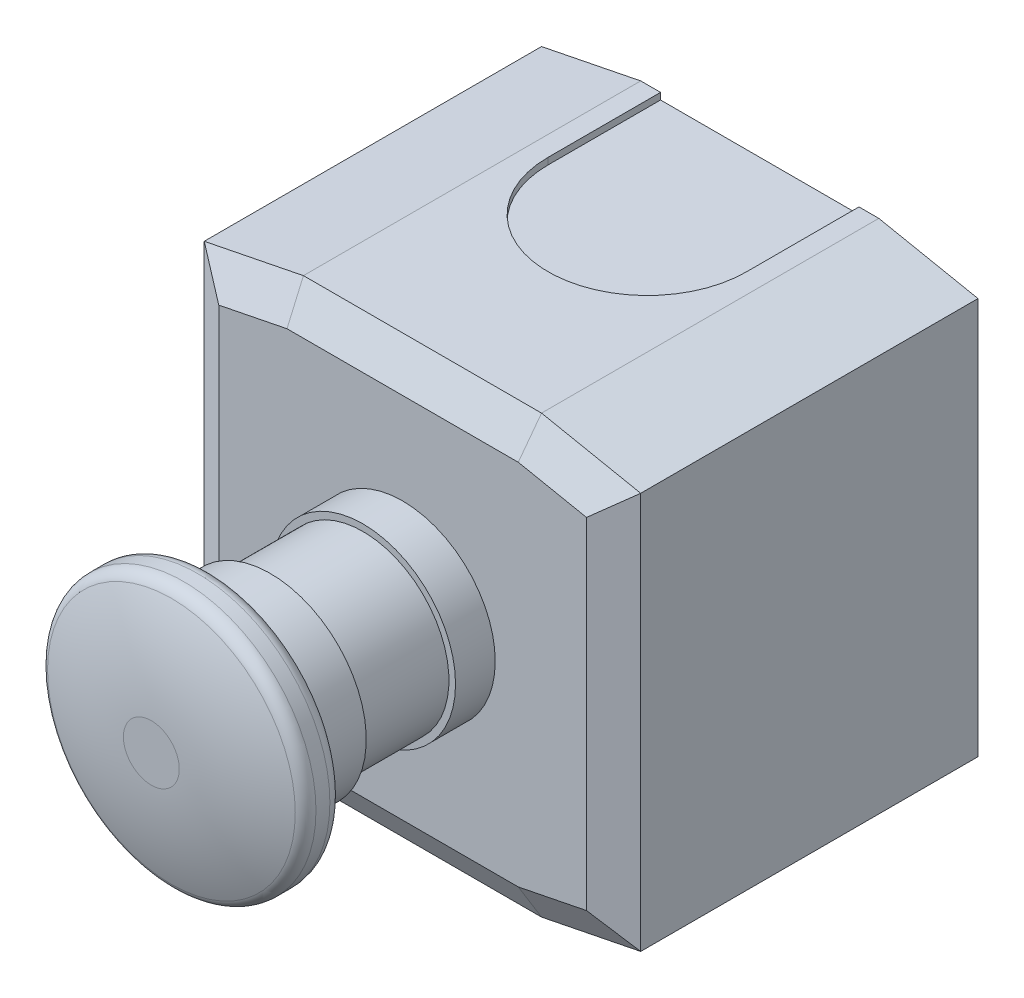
ISO-10303-21;
HEADER;
FILE_DESCRIPTION(('STEP AP214'),'2;1');
FILE_NAME('part.step','',(''),(''),'','','');
FILE_SCHEMA(('AUTOMOTIVE_DESIGN { 1 0 10303 214 1 1 1 1 }'));
ENDSEC;
DATA;
#1=APPLICATION_CONTEXT('core data for automotive mechanical design processes');
#2=APPLICATION_PROTOCOL_DEFINITION('international standard','automotive_design',2000,#1);
#3=PRODUCT_CONTEXT('',#1,'mechanical');
#4=PRODUCT('Part','Part','',(#3));
#5=PRODUCT_RELATED_PRODUCT_CATEGORY('part','',(#4));
#6=PRODUCT_DEFINITION_FORMATION('','',#4);
#7=PRODUCT_DEFINITION_CONTEXT('part definition',#1,'design');
#8=PRODUCT_DEFINITION('design','',#6,#7);
#9=PRODUCT_DEFINITION_SHAPE('','',#8);
#10=(LENGTH_UNIT() NAMED_UNIT(*) SI_UNIT(.MILLI.,.METRE.));
#11=(NAMED_UNIT(*) PLANE_ANGLE_UNIT() SI_UNIT($,.RADIAN.));
#12=(NAMED_UNIT(*) SI_UNIT($,.STERADIAN.) SOLID_ANGLE_UNIT());
#13=UNCERTAINTY_MEASURE_WITH_UNIT(LENGTH_MEASURE(1.E-05),#10,'distance_accuracy_value','');
#14=(GEOMETRIC_REPRESENTATION_CONTEXT(3) GLOBAL_UNCERTAINTY_ASSIGNED_CONTEXT((#13)) GLOBAL_UNIT_ASSIGNED_CONTEXT((#10,
#11,#12)) REPRESENTATION_CONTEXT('',''));
#15=CARTESIAN_POINT('',(0.,0.,0.));
#16=DIRECTION('',(0.,0.,1.));
#17=DIRECTION('',(1.,0.,0.));
#18=AXIS2_PLACEMENT_3D('',#15,#16,#17);
#19=CARTESIAN_POINT('',(-18.,33.,54.));
#20=DIRECTION('',(0.,-1.,0.));
#21=DIRECTION('',(0.,0.,-1.));
#22=AXIS2_PLACEMENT_3D('',#19,#20,#21);
#23=PLANE('',#22);
#24=DIRECTION('',(0.,0.,-1.));
#25=VECTOR('',#24,1.);
#26=CARTESIAN_POINT('',(-15.,33.,0.));
#27=LINE('',#26,#25);
#28=CARTESIAN_POINT('',(-15.,33.,17.));
#29=VERTEX_POINT('',#28);
#30=CARTESIAN_POINT('',(-15.,33.,0.));
#31=VERTEX_POINT('',#30);
#32=EDGE_CURVE('E190',#29,#31,#27,.T.);
#33=ORIENTED_EDGE('',*,*,#32,.T.);
#34=DIRECTION('',(-1.,0.,0.));
#35=VECTOR('',#34,1.);
#36=CARTESIAN_POINT('',(-18.,33.,0.));
#37=LINE('',#36,#35);
#38=CARTESIAN_POINT('',(-18.,33.,0.));
#39=VERTEX_POINT('',#38);
#40=EDGE_CURVE('E253',#31,#39,#37,.T.);
#41=ORIENTED_EDGE('',*,*,#40,.T.);
#42=DIRECTION('',(0.,0.,-1.));
#43=VECTOR('',#42,1.);
#44=CARTESIAN_POINT('',(-18.,33.,54.));
#45=LINE('',#44,#43);
#46=CARTESIAN_POINT('',(-18.,33.,51.));
#47=VERTEX_POINT('',#46);
#48=EDGE_CURVE('E292',#47,#39,#45,.T.);
#49=ORIENTED_EDGE('',*,*,#48,.F.);
#50=DIRECTION('',(1.,0.,0.));
#51=VECTOR('',#50,1.);
#52=CARTESIAN_POINT('',(-18.,33.,51.));
#53=LINE('',#52,#51);
#54=CARTESIAN_POINT('',(18.,33.,51.));
#55=VERTEX_POINT('',#54);
#56=EDGE_CURVE('E11',#47,#55,#53,.T.);
#57=ORIENTED_EDGE('',*,*,#56,.T.);
#58=DIRECTION('',(0.,0.,-1.));
#59=VECTOR('',#58,1.);
#60=CARTESIAN_POINT('',(18.,33.,54.));
#61=LINE('',#60,#59);
#62=CARTESIAN_POINT('',(18.,33.,0.));
#63=VERTEX_POINT('',#62);
#64=EDGE_CURVE('E277',#55,#63,#61,.T.);
#65=ORIENTED_EDGE('',*,*,#64,.T.);
#66=CARTESIAN_POINT('',(15.,33.,0.));
#67=VERTEX_POINT('',#66);
#68=EDGE_CURVE('E189',#63,#67,#37,.T.);
#69=ORIENTED_EDGE('',*,*,#68,.T.);
#70=DIRECTION('',(0.,0.,1.));
#71=VECTOR('',#70,1.);
#72=CARTESIAN_POINT('',(15.,33.,17.));
#73=LINE('',#72,#71);
#74=CARTESIAN_POINT('',(15.,33.,17.));
#75=VERTEX_POINT('',#74);
#76=EDGE_CURVE('E170',#67,#75,#73,.T.);
#77=ORIENTED_EDGE('',*,*,#76,.T.);
#78=CARTESIAN_POINT('',(0.,33.,17.));
#79=DIRECTION('',(0.,-1.,0.));
#80=DIRECTION('',(0.,0.,-1.));
#81=AXIS2_PLACEMENT_3D('',#78,#79,#80);
#82=CIRCLE('',#81,15.);
#83=EDGE_CURVE('E179',#75,#29,#82,.T.);
#84=ORIENTED_EDGE('',*,*,#83,.T.);
#85=EDGE_LOOP('',(#33,#41,#49,#57,#65,#69,#77,#84));
#86=FACE_BOUND('',#85,.T.);
#87=ADVANCED_FACE('F30',(#86),#23,.F.);
#88=CARTESIAN_POINT('',(-33.,33.,0.));
#89=DIRECTION('',(0.,0.,-1.));
#90=DIRECTION('',(-1.,0.,0.));
#91=AXIS2_PLACEMENT_3D('',#88,#89,#90);
#92=PLANE('',#91);
#93=CARTESIAN_POINT('',(-27.,0.,0.));
#94=DIRECTION('',(0.,0.,-1.));
#95=DIRECTION('',(-1.,0.,0.));
#96=AXIS2_PLACEMENT_3D('',#93,#94,#95);
#97=CIRCLE('',#96,2.15);
#98=CARTESIAN_POINT('',(-29.15,0.,0.));
#99=VERTEX_POINT('',#98);
#100=EDGE_CURVE('E745',#99,#99,#97,.T.);
#101=ORIENTED_EDGE('',*,*,#100,.F.);
#102=EDGE_LOOP('',(#101));
#103=FACE_BOUND('',#102,.T.);
#104=CARTESIAN_POINT('',(27.,0.,0.));
#105=DIRECTION('',(0.,0.,-1.));
#106=DIRECTION('',(-1.,0.,0.));
#107=AXIS2_PLACEMENT_3D('',#104,#105,#106);
#108=CIRCLE('',#107,2.15);
#109=CARTESIAN_POINT('',(24.85,0.,0.));
#110=VERTEX_POINT('',#109);
#111=EDGE_CURVE('E744',#110,#110,#108,.T.);
#112=ORIENTED_EDGE('',*,*,#111,.F.);
#113=EDGE_LOOP('',(#112));
#114=FACE_BOUND('',#113,.T.);
#115=ORIENTED_EDGE('',*,*,#40,.F.);
#116=DIRECTION('',(0.,1.,0.));
#117=VECTOR('',#116,1.);
#118=CARTESIAN_POINT('',(-15.,32.,0.));
#119=LINE('',#118,#117);
#120=CARTESIAN_POINT('',(-15.,32.,0.));
#121=VERTEX_POINT('',#120);
#122=EDGE_CURVE('E204',#121,#31,#119,.T.);
#123=ORIENTED_EDGE('',*,*,#122,.F.);
#124=DIRECTION('',(1.,0.,0.));
#125=VECTOR('',#124,1.);
#126=CARTESIAN_POINT('',(15.,32.,0.));
#127=LINE('',#126,#125);
#128=CARTESIAN_POINT('',(15.,32.,0.));
#129=VERTEX_POINT('',#128);
#130=EDGE_CURVE('E198',#121,#129,#127,.T.);
#131=ORIENTED_EDGE('',*,*,#130,.T.);
#132=DIRECTION('',(0.,1.,0.));
#133=VECTOR('',#132,1.);
#134=CARTESIAN_POINT('',(15.,32.,0.));
#135=LINE('',#134,#133);
#136=EDGE_CURVE('E174',#129,#67,#135,.T.);
#137=ORIENTED_EDGE('',*,*,#136,.T.);
#138=ORIENTED_EDGE('',*,*,#68,.F.);
#139=DIRECTION('',(-0.98058067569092,0.196116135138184,0.));
#140=VECTOR('',#139,1.);
#141=CARTESIAN_POINT('',(18.,33.,0.));
#142=LINE('',#141,#140);
#143=CARTESIAN_POINT('',(33.,30.,0.));
#144=VERTEX_POINT('',#143);
#145=EDGE_CURVE('E274',#144,#63,#142,.T.);
#146=ORIENTED_EDGE('',*,*,#145,.F.);
#147=DIRECTION('',(0.,1.,0.));
#148=VECTOR('',#147,1.);
#149=CARTESIAN_POINT('',(33.,30.,0.));
#150=LINE('',#149,#148);
#151=CARTESIAN_POINT('',(33.,-30.,0.));
#152=VERTEX_POINT('',#151);
#153=EDGE_CURVE('E271',#152,#144,#150,.T.);
#154=ORIENTED_EDGE('',*,*,#153,.F.);
#155=DIRECTION('',(0.98058067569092,0.196116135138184,0.));
#156=VECTOR('',#155,1.);
#157=CARTESIAN_POINT('',(18.,-33.,0.));
#158=LINE('',#157,#156);
#159=CARTESIAN_POINT('',(18.,-33.,0.));
#160=VERTEX_POINT('',#159);
#161=EDGE_CURVE('E268',#160,#152,#158,.T.);
#162=ORIENTED_EDGE('',*,*,#161,.F.);
#163=DIRECTION('',(1.,0.,0.));
#164=VECTOR('',#163,1.);
#165=CARTESIAN_POINT('',(-18.,-33.,0.));
#166=LINE('',#165,#164);
#167=CARTESIAN_POINT('',(15.,-33.,0.));
#168=VERTEX_POINT('',#167);
#169=EDGE_CURVE('E264',#168,#160,#166,.T.);
#170=ORIENTED_EDGE('',*,*,#169,.F.);
#171=DIRECTION('',(0.,-1.,0.));
#172=VECTOR('',#171,1.);
#173=CARTESIAN_POINT('',(15.,-32.,0.));
#174=LINE('',#173,#172);
#175=CARTESIAN_POINT('',(15.,-32.,0.));
#176=VERTEX_POINT('',#175);
#177=EDGE_CURVE('E226',#176,#168,#174,.T.);
#178=ORIENTED_EDGE('',*,*,#177,.F.);
#179=DIRECTION('',(1.,0.,0.));
#180=VECTOR('',#179,1.);
#181=CARTESIAN_POINT('',(15.,-32.,0.));
#182=LINE('',#181,#180);
#183=CARTESIAN_POINT('',(-15.,-32.,0.));
#184=VERTEX_POINT('',#183);
#185=EDGE_CURVE('E217',#184,#176,#182,.T.);
#186=ORIENTED_EDGE('',*,*,#185,.F.);
#187=DIRECTION('',(0.,-1.,0.));
#188=VECTOR('',#187,1.);
#189=CARTESIAN_POINT('',(-15.,-32.,0.));
#190=LINE('',#189,#188);
#191=CARTESIAN_POINT('',(-15.,-33.,0.));
#192=VERTEX_POINT('',#191);
#193=EDGE_CURVE('E228',#184,#192,#190,.T.);
#194=ORIENTED_EDGE('',*,*,#193,.T.);
#195=CARTESIAN_POINT('',(-18.,-33.,0.));
#196=VERTEX_POINT('',#195);
#197=EDGE_CURVE('E265',#196,#192,#166,.T.);
#198=ORIENTED_EDGE('',*,*,#197,.F.);
#199=DIRECTION('',(0.98058067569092,-0.196116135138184,0.));
#200=VECTOR('',#199,1.);
#201=CARTESIAN_POINT('',(-18.,-33.,0.));
#202=LINE('',#201,#200);
#203=CARTESIAN_POINT('',(-33.,-30.,0.));
#204=VERTEX_POINT('',#203);
#205=EDGE_CURVE('E261',#204,#196,#202,.T.);
#206=ORIENTED_EDGE('',*,*,#205,.F.);
#207=DIRECTION('',(0.,-1.,0.));
#208=VECTOR('',#207,1.);
#209=CARTESIAN_POINT('',(-33.,30.,0.));
#210=LINE('',#209,#208);
#211=CARTESIAN_POINT('',(-33.,30.,0.));
#212=VERTEX_POINT('',#211);
#213=EDGE_CURVE('E258',#212,#204,#210,.T.);
#214=ORIENTED_EDGE('',*,*,#213,.F.);
#215=DIRECTION('',(-0.98058067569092,-0.196116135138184,0.));
#216=VECTOR('',#215,1.);
#217=CARTESIAN_POINT('',(-18.,33.,0.));
#218=LINE('',#217,#216);
#219=EDGE_CURVE('E255',#39,#212,#218,.T.);
#220=ORIENTED_EDGE('',*,*,#219,.F.);
#221=EDGE_LOOP('',(#115,#123,#131,#137,#138,#146,#154,#162,#170,#178,#186,#194,#198,#206,#214,#220));
#222=FACE_BOUND('',#221,.T.);
#223=ADVANCED_FACE('F358',(#103,#114,#222),#92,.T.);
#224=CARTESIAN_POINT('',(-18.,33.,54.));
#225=DIRECTION('',(0.196116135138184,-0.98058067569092,0.));
#226=DIRECTION('',(0.98058067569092,0.196116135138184,0.));
#227=AXIS2_PLACEMENT_3D('',#224,#225,#226);
#228=PLANE('',#227);
#229=DIRECTION('',(0.,0.,-1.));
#230=VECTOR('',#229,1.);
#231=CARTESIAN_POINT('',(-33.,30.,54.));
#232=LINE('',#231,#230);
#233=CARTESIAN_POINT('',(-33.,30.,51.));
#234=VERTEX_POINT('',#233);
#235=EDGE_CURVE('E290',#234,#212,#232,.T.);
#236=ORIENTED_EDGE('',*,*,#235,.F.);
#237=DIRECTION('',(0.98058067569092,0.196116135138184,0.));
#238=VECTOR('',#237,1.);
#239=CARTESIAN_POINT('',(-18.,33.,51.));
#240=LINE('',#239,#238);
#241=EDGE_CURVE('E37',#234,#47,#240,.T.);
#242=ORIENTED_EDGE('',*,*,#241,.T.);
#243=ORIENTED_EDGE('',*,*,#48,.T.);
#244=ORIENTED_EDGE('',*,*,#219,.T.);
#245=EDGE_LOOP('',(#236,#242,#243,#244));
#246=FACE_BOUND('',#245,.T.);
#247=ADVANCED_FACE('F328',(#246),#228,.F.);
#248=CARTESIAN_POINT('',(-33.,30.,54.));
#249=DIRECTION('',(1.,0.,0.));
#250=DIRECTION('',(0.,0.,-1.));
#251=AXIS2_PLACEMENT_3D('',#248,#249,#250);
#252=PLANE('',#251);
#253=DIRECTION('',(0.,0.,-1.));
#254=VECTOR('',#253,1.);
#255=CARTESIAN_POINT('',(-33.,-30.,54.));
#256=LINE('',#255,#254);
#257=CARTESIAN_POINT('',(-33.,-30.,51.));
#258=VERTEX_POINT('',#257);
#259=EDGE_CURVE('E288',#258,#204,#256,.T.);
#260=ORIENTED_EDGE('',*,*,#259,.F.);
#261=DIRECTION('',(0.,1.,0.));
#262=VECTOR('',#261,1.);
#263=CARTESIAN_POINT('',(-33.,30.,51.));
#264=LINE('',#263,#262);
#265=EDGE_CURVE('E323',#258,#234,#264,.T.);
#266=ORIENTED_EDGE('',*,*,#265,.T.);
#267=ORIENTED_EDGE('',*,*,#235,.T.);
#268=ORIENTED_EDGE('',*,*,#213,.T.);
#269=EDGE_LOOP('',(#260,#266,#267,#268));
#270=FACE_BOUND('',#269,.T.);
#271=ADVANCED_FACE('F368',(#270),#252,.F.);
#272=CARTESIAN_POINT('',(-18.,-33.,54.));
#273=DIRECTION('',(0.196116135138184,0.98058067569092,0.));
#274=DIRECTION('',(-0.98058067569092,0.196116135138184,0.));
#275=AXIS2_PLACEMENT_3D('',#272,#273,#274);
#276=PLANE('',#275);
#277=DIRECTION('',(0.,0.,-1.));
#278=VECTOR('',#277,1.);
#279=CARTESIAN_POINT('',(-18.,-33.,54.));
#280=LINE('',#279,#278);
#281=CARTESIAN_POINT('',(-18.,-33.,51.));
#282=VERTEX_POINT('',#281);
#283=EDGE_CURVE('E286',#282,#196,#280,.T.);
#284=ORIENTED_EDGE('',*,*,#283,.F.);
#285=DIRECTION('',(-0.98058067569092,0.196116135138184,0.));
#286=VECTOR('',#285,1.);
#287=CARTESIAN_POINT('',(-18.,-33.,51.));
#288=LINE('',#287,#286);
#289=EDGE_CURVE('E321',#282,#258,#288,.T.);
#290=ORIENTED_EDGE('',*,*,#289,.T.);
#291=ORIENTED_EDGE('',*,*,#259,.T.);
#292=ORIENTED_EDGE('',*,*,#205,.T.);
#293=EDGE_LOOP('',(#284,#290,#291,#292));
#294=FACE_BOUND('',#293,.T.);
#295=ADVANCED_FACE('F430',(#294),#276,.F.);
#296=CARTESIAN_POINT('',(-18.,-33.,54.));
#297=DIRECTION('',(0.,1.,0.));
#298=DIRECTION('',(0.,0.,1.));
#299=AXIS2_PLACEMENT_3D('',#296,#297,#298);
#300=PLANE('',#299);
#301=CARTESIAN_POINT('',(0.,-33.,17.));
#302=DIRECTION('',(0.,-1.,0.));
#303=DIRECTION('',(0.,0.,-1.));
#304=AXIS2_PLACEMENT_3D('',#301,#302,#303);
#305=CIRCLE('',#304,15.);
#306=CARTESIAN_POINT('',(15.,-33.,17.));
#307=VERTEX_POINT('',#306);
#308=CARTESIAN_POINT('',(-15.,-33.,17.));
#309=VERTEX_POINT('',#308);
#310=EDGE_CURVE('E203',#307,#309,#305,.T.);
#311=ORIENTED_EDGE('',*,*,#310,.F.);
#312=DIRECTION('',(0.,0.,1.));
#313=VECTOR('',#312,1.);
#314=CARTESIAN_POINT('',(15.,-33.,17.));
#315=LINE('',#314,#313);
#316=EDGE_CURVE('E211',#168,#307,#315,.T.);
#317=ORIENTED_EDGE('',*,*,#316,.F.);
#318=ORIENTED_EDGE('',*,*,#169,.T.);
#319=DIRECTION('',(0.,0.,-1.));
#320=VECTOR('',#319,1.);
#321=CARTESIAN_POINT('',(18.,-33.,54.));
#322=LINE('',#321,#320);
#323=CARTESIAN_POINT('',(18.,-33.,51.));
#324=VERTEX_POINT('',#323);
#325=EDGE_CURVE('E283',#324,#160,#322,.T.);
#326=ORIENTED_EDGE('',*,*,#325,.F.);
#327=DIRECTION('',(-1.,0.,0.));
#328=VECTOR('',#327,1.);
#329=CARTESIAN_POINT('',(-18.,-33.,51.));
#330=LINE('',#329,#328);
#331=EDGE_CURVE('E319',#324,#282,#330,.T.);
#332=ORIENTED_EDGE('',*,*,#331,.T.);
#333=ORIENTED_EDGE('',*,*,#283,.T.);
#334=ORIENTED_EDGE('',*,*,#197,.T.);
#335=DIRECTION('',(0.,0.,-1.));
#336=VECTOR('',#335,1.);
#337=CARTESIAN_POINT('',(-15.,-33.,0.));
#338=LINE('',#337,#336);
#339=EDGE_CURVE('E209',#309,#192,#338,.T.);
#340=ORIENTED_EDGE('',*,*,#339,.F.);
#341=EDGE_LOOP('',(#311,#317,#318,#326,#332,#333,#334,#340));
#342=FACE_BOUND('',#341,.T.);
#343=ADVANCED_FACE('F426',(#342),#300,.F.);
#344=CARTESIAN_POINT('',(18.,-33.,54.));
#345=DIRECTION('',(-0.196116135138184,0.98058067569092,0.));
#346=DIRECTION('',(-0.98058067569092,-0.196116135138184,0.));
#347=AXIS2_PLACEMENT_3D('',#344,#345,#346);
#348=PLANE('',#347);
#349=DIRECTION('',(0.,0.,-1.));
#350=VECTOR('',#349,1.);
#351=CARTESIAN_POINT('',(33.,-30.,54.));
#352=LINE('',#351,#350);
#353=CARTESIAN_POINT('',(33.,-30.,51.));
#354=VERTEX_POINT('',#353);
#355=EDGE_CURVE('E281',#354,#152,#352,.T.);
#356=ORIENTED_EDGE('',*,*,#355,.F.);
#357=DIRECTION('',(-0.98058067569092,-0.196116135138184,0.));
#358=VECTOR('',#357,1.);
#359=CARTESIAN_POINT('',(18.,-33.,51.));
#360=LINE('',#359,#358);
#361=EDGE_CURVE('E317',#354,#324,#360,.T.);
#362=ORIENTED_EDGE('',*,*,#361,.T.);
#363=ORIENTED_EDGE('',*,*,#325,.T.);
#364=ORIENTED_EDGE('',*,*,#161,.T.);
#365=EDGE_LOOP('',(#356,#362,#363,#364));
#366=FACE_BOUND('',#365,.T.);
#367=ADVANCED_FACE('F423',(#366),#348,.F.);
#368=CARTESIAN_POINT('',(33.,30.,54.));
#369=DIRECTION('',(-1.,0.,0.));
#370=DIRECTION('',(0.,-1.,0.));
#371=AXIS2_PLACEMENT_3D('',#368,#369,#370);
#372=PLANE('',#371);
#373=DIRECTION('',(0.,0.,-1.));
#374=VECTOR('',#373,1.);
#375=CARTESIAN_POINT('',(33.,30.,54.));
#376=LINE('',#375,#374);
#377=CARTESIAN_POINT('',(33.,30.,51.));
#378=VERTEX_POINT('',#377);
#379=EDGE_CURVE('E279',#378,#144,#376,.T.);
#380=ORIENTED_EDGE('',*,*,#379,.F.);
#381=DIRECTION('',(0.,-1.,0.));
#382=VECTOR('',#381,1.);
#383=CARTESIAN_POINT('',(33.,30.,51.));
#384=LINE('',#383,#382);
#385=EDGE_CURVE('E315',#378,#354,#384,.T.);
#386=ORIENTED_EDGE('',*,*,#385,.T.);
#387=ORIENTED_EDGE('',*,*,#355,.T.);
#388=ORIENTED_EDGE('',*,*,#153,.T.);
#389=EDGE_LOOP('',(#380,#386,#387,#388));
#390=FACE_BOUND('',#389,.T.);
#391=ADVANCED_FACE('F352',(#390),#372,.F.);
#392=CARTESIAN_POINT('',(18.,33.,54.));
#393=DIRECTION('',(-0.196116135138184,-0.98058067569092,0.));
#394=DIRECTION('',(0.98058067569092,-0.196116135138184,0.));
#395=AXIS2_PLACEMENT_3D('',#392,#393,#394);
#396=PLANE('',#395);
#397=ORIENTED_EDGE('',*,*,#64,.F.);
#398=DIRECTION('',(0.98058067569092,-0.196116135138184,0.));
#399=VECTOR('',#398,1.);
#400=CARTESIAN_POINT('',(18.,33.,51.));
#401=LINE('',#400,#399);
#402=EDGE_CURVE('E312',#55,#378,#401,.T.);
#403=ORIENTED_EDGE('',*,*,#402,.T.);
#404=ORIENTED_EDGE('',*,*,#379,.T.);
#405=ORIENTED_EDGE('',*,*,#145,.T.);
#406=EDGE_LOOP('',(#397,#403,#404,#405));
#407=FACE_BOUND('',#406,.T.);
#408=ADVANCED_FACE('F350',(#407),#396,.F.);
#409=CARTESIAN_POINT('',(-33.,33.,54.));
#410=DIRECTION('',(0.,0.,-1.));
#411=DIRECTION('',(-1.,0.,0.));
#412=AXIS2_PLACEMENT_3D('',#409,#410,#411);
#413=PLANE('',#412);
#414=CARTESIAN_POINT('',(0.,0.,54.));
#415=DIRECTION('',(0.,0.,-1.));
#416=DIRECTION('',(-1.,0.,0.));
#417=AXIS2_PLACEMENT_3D('',#414,#415,#416);
#418=CIRCLE('',#417,14.);
#419=CARTESIAN_POINT('',(-14.,0.,54.));
#420=VERTEX_POINT('',#419);
#421=EDGE_CURVE('E755',#420,#420,#418,.T.);
#422=ORIENTED_EDGE('',*,*,#421,.T.);
#423=EDGE_LOOP('',(#422));
#424=FACE_BOUND('',#423,.T.);
#425=DIRECTION('',(0.,1.,0.));
#426=VECTOR('',#425,1.);
#427=CARTESIAN_POINT('',(27.8038475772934,33.,54.));
#428=LINE('',#427,#426);
#429=CARTESIAN_POINT('',(27.8038475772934,-25.7401739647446,54.));
#430=VERTEX_POINT('',#429);
#431=CARTESIAN_POINT('',(27.8038475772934,25.7401739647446,54.));
#432=VERTEX_POINT('',#431);
#433=EDGE_CURVE('E307',#430,#432,#428,.T.);
#434=ORIENTED_EDGE('',*,*,#433,.T.);
#435=DIRECTION('',(-0.98058067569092,0.196116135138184,0.));
#436=VECTOR('',#435,1.);
#437=CARTESIAN_POINT('',(-32.0575108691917,37.7124456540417,54.));
#438=LINE('',#437,#436);
#439=CARTESIAN_POINT('',(17.4854795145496,27.8038475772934,54.));
#440=VERTEX_POINT('',#439);
#441=EDGE_CURVE('E309',#432,#440,#438,.T.);
#442=ORIENTED_EDGE('',*,*,#441,.T.);
#443=DIRECTION('',(-1.,0.,0.));
#444=VECTOR('',#443,1.);
#445=CARTESIAN_POINT('',(-33.,27.8038475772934,54.));
#446=LINE('',#445,#444);
#447=CARTESIAN_POINT('',(-17.4854795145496,27.8038475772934,54.));
#448=VERTEX_POINT('',#447);
#449=EDGE_CURVE('E295',#440,#448,#446,.T.);
#450=ORIENTED_EDGE('',*,*,#449,.T.);
#451=DIRECTION('',(-0.98058067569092,-0.196116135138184,0.));
#452=VECTOR('',#451,1.);
#453=CARTESIAN_POINT('',(-31.4040275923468,25.020137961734,54.));
#454=LINE('',#453,#452);
#455=CARTESIAN_POINT('',(-27.8038475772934,25.7401739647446,54.));
#456=VERTEX_POINT('',#455);
#457=EDGE_CURVE('E297',#448,#456,#454,.T.);
#458=ORIENTED_EDGE('',*,*,#457,.T.);
#459=DIRECTION('',(0.,-1.,0.));
#460=VECTOR('',#459,1.);
#461=CARTESIAN_POINT('',(-27.8038475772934,33.,54.));
#462=LINE('',#461,#460);
#463=CARTESIAN_POINT('',(-27.8038475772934,-25.7401739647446,54.));
#464=VERTEX_POINT('',#463);
#465=EDGE_CURVE('E299',#456,#464,#462,.T.);
#466=ORIENTED_EDGE('',*,*,#465,.T.);
#467=DIRECTION('',(0.98058067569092,-0.196116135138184,0.));
#468=VECTOR('',#467,1.);
#469=CARTESIAN_POINT('',(-44.0963352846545,-22.4816764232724,54.));
#470=LINE('',#469,#468);
#471=CARTESIAN_POINT('',(-17.4854795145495,-27.8038475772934,54.));
#472=VERTEX_POINT('',#471);
#473=EDGE_CURVE('E301',#464,#472,#470,.T.);
#474=ORIENTED_EDGE('',*,*,#473,.T.);
#475=DIRECTION('',(1.,0.,0.));
#476=VECTOR('',#475,1.);
#477=CARTESIAN_POINT('',(-33.,-27.8038475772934,54.));
#478=LINE('',#477,#476);
#479=CARTESIAN_POINT('',(17.4854795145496,-27.8038475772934,54.));
#480=VERTEX_POINT('',#479);
#481=EDGE_CURVE('E303',#472,#480,#478,.T.);
#482=ORIENTED_EDGE('',*,*,#481,.T.);
#483=DIRECTION('',(0.98058067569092,0.196116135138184,0.));
#484=VECTOR('',#483,1.);
#485=CARTESIAN_POINT('',(-19.365203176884,-35.1739841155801,54.));
#486=LINE('',#485,#484);
#487=EDGE_CURVE('E305',#480,#430,#486,.T.);
#488=ORIENTED_EDGE('',*,*,#487,.T.);
#489=EDGE_LOOP('',(#434,#442,#450,#458,#466,#474,#482,#488));
#490=FACE_BOUND('',#489,.T.);
#491=ADVANCED_FACE('F376',(#424,#490),#413,.F.);
#492=CARTESIAN_POINT('',(-44.0963352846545,-22.4816764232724,54.));
#493=DIRECTION('',(0.0980580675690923,0.490290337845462,-0.866025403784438));
#494=DIRECTION('',(0.,0.870219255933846,0.492664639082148));
#495=AXIS2_PLACEMENT_3D('',#492,#493,#494);
#496=PLANE('',#495);
#497=DIRECTION('',(0.706152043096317,0.578906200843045,0.407697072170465));
#498=VECTOR('',#497,1.);
#499=CARTESIAN_POINT('',(-3.7911113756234,-6.05443911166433,67.8637597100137));
#500=LINE('',#499,#498);
#501=EDGE_CURVE('E247',#258,#464,#500,.T.);
#502=ORIENTED_EDGE('',*,*,#501,.F.);
#503=ORIENTED_EDGE('',*,*,#289,.F.);
#504=DIRECTION('',(0.085439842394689,0.862858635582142,0.498171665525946));
#505=VECTOR('',#504,1.);
#506=CARTESIAN_POINT('',(-17.287374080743,-25.8031769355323,55.1550877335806));
#507=LINE('',#506,#505);
#508=EDGE_CURVE('E250',#472,#282,#507,.F.);
#509=ORIENTED_EDGE('',*,*,#508,.F.);
#510=ORIENTED_EDGE('',*,*,#473,.F.);
#511=EDGE_LOOP('',(#502,#503,#509,#510));
#512=FACE_BOUND('',#511,.T.);
#513=ADVANCED_FACE('F379',(#512),#496,.F.);
#514=CARTESIAN_POINT('',(-33.,-27.8038475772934,54.));
#515=DIRECTION('',(0.,0.500000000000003,-0.866025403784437));
#516=DIRECTION('',(0.,0.866025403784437,0.500000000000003));
#517=AXIS2_PLACEMENT_3D('',#514,#515,#516);
#518=PLANE('',#517);
#519=ORIENTED_EDGE('',*,*,#508,.T.);
#520=ORIENTED_EDGE('',*,*,#331,.F.);
#521=DIRECTION('',(-0.0854398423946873,0.862858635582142,0.498171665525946));
#522=VECTOR('',#521,1.);
#523=CARTESIAN_POINT('',(17.1169371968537,-24.0819315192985,56.1488492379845));
#524=LINE('',#523,#522);
#525=EDGE_CURVE('E244',#480,#324,#524,.F.);
#526=ORIENTED_EDGE('',*,*,#525,.F.);
#527=ORIENTED_EDGE('',*,*,#481,.F.);
#528=EDGE_LOOP('',(#519,#520,#526,#527));
#529=FACE_BOUND('',#528,.T.);
#530=ADVANCED_FACE('F385',(#529),#518,.F.);
#531=CARTESIAN_POINT('',(-27.8038475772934,33.,54.));
#532=DIRECTION('',(0.500000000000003,0.,-0.866025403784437));
#533=DIRECTION('',(-0.866025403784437,0.,-0.500000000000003));
#534=AXIS2_PLACEMENT_3D('',#531,#532,#533);
#535=PLANE('',#534);
#536=ORIENTED_EDGE('',*,*,#501,.T.);
#537=ORIENTED_EDGE('',*,*,#465,.F.);
#538=DIRECTION('',(0.706152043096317,-0.578906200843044,0.407697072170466));
#539=VECTOR('',#538,1.);
#540=CARTESIAN_POINT('',(-29.3047321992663,26.9706050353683,53.1334638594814));
#541=LINE('',#540,#539);
#542=EDGE_CURVE('E241',#234,#456,#541,.T.);
#543=ORIENTED_EDGE('',*,*,#542,.F.);
#544=ORIENTED_EDGE('',*,*,#265,.F.);
#545=EDGE_LOOP('',(#536,#537,#543,#544));
#546=FACE_BOUND('',#545,.T.);
#547=ADVANCED_FACE('F372',(#546),#535,.F.);
#548=CARTESIAN_POINT('',(-19.365203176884,-35.1739841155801,54.));
#549=DIRECTION('',(-0.0980580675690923,0.490290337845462,-0.866025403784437));
#550=DIRECTION('',(0.,0.870219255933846,0.492664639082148));
#551=AXIS2_PLACEMENT_3D('',#548,#549,#550);
#552=PLANE('',#551);
#553=ORIENTED_EDGE('',*,*,#525,.T.);
#554=ORIENTED_EDGE('',*,*,#361,.F.);
#555=DIRECTION('',(-0.706152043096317,0.578906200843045,0.407697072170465));
#556=VECTOR('',#555,1.);
#557=CARTESIAN_POINT('',(8.13946895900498,-9.61923962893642,65.3532342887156));
#558=LINE('',#557,#556);
#559=EDGE_CURVE('E238',#430,#354,#558,.F.);
#560=ORIENTED_EDGE('',*,*,#559,.F.);
#561=ORIENTED_EDGE('',*,*,#487,.F.);
#562=EDGE_LOOP('',(#553,#554,#560,#561));
#563=FACE_BOUND('',#562,.T.);
#564=ADVANCED_FACE('F391',(#563),#552,.F.);
#565=CARTESIAN_POINT('',(-31.4040275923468,25.020137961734,54.));
#566=DIRECTION('',(0.0980580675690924,-0.490290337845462,-0.866025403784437));
#567=DIRECTION('',(0.,0.870219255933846,-0.492664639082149));
#568=AXIS2_PLACEMENT_3D('',#565,#566,#567);
#569=PLANE('',#568);
#570=ORIENTED_EDGE('',*,*,#542,.T.);
#571=ORIENTED_EDGE('',*,*,#457,.F.);
#572=DIRECTION('',(0.0854398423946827,-0.862858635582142,0.498171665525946));
#573=VECTOR('',#572,1.);
#574=CARTESIAN_POINT('',(-17.59873499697,28.9476169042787,53.3396444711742));
#575=LINE('',#574,#573);
#576=EDGE_CURVE('E235',#47,#448,#575,.T.);
#577=ORIENTED_EDGE('',*,*,#576,.F.);
#578=ORIENTED_EDGE('',*,*,#241,.F.);
#579=EDGE_LOOP('',(#570,#571,#577,#578));
#580=FACE_BOUND('',#579,.T.);
#581=ADVANCED_FACE('F337',(#580),#569,.F.);
#582=CARTESIAN_POINT('',(27.8038475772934,33.,54.));
#583=DIRECTION('',(-0.500000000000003,0.,-0.866025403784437));
#584=DIRECTION('',(-0.866025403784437,0.,0.500000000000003));
#585=AXIS2_PLACEMENT_3D('',#582,#583,#584);
#586=PLANE('',#585);
#587=ORIENTED_EDGE('',*,*,#559,.T.);
#588=ORIENTED_EDGE('',*,*,#385,.F.);
#589=DIRECTION('',(-0.706152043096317,-0.578906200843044,0.407697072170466));
#590=VECTOR('',#589,1.);
#591=CARTESIAN_POINT('',(30.7716339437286,28.1731768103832,52.2865477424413));
#592=LINE('',#591,#590);
#593=EDGE_CURVE('E233',#432,#378,#592,.F.);
#594=ORIENTED_EDGE('',*,*,#593,.F.);
#595=ORIENTED_EDGE('',*,*,#433,.F.);
#596=EDGE_LOOP('',(#587,#588,#594,#595));
#597=FACE_BOUND('',#596,.T.);
#598=ADVANCED_FACE('F393',(#597),#586,.F.);
#599=CARTESIAN_POINT('',(-33.,27.8038475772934,54.));
#600=DIRECTION('',(0.,-0.500000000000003,-0.866025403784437));
#601=DIRECTION('',(0.,0.866025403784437,-0.500000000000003));
#602=AXIS2_PLACEMENT_3D('',#599,#600,#601);
#603=PLANE('',#602);
#604=ORIENTED_EDGE('',*,*,#576,.T.);
#605=ORIENTED_EDGE('',*,*,#449,.F.);
#606=DIRECTION('',(0.0854398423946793,0.862858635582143,-0.498171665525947));
#607=VECTOR('',#606,1.);
#608=CARTESIAN_POINT('',(17.1169371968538,24.0819315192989,56.1488492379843));
#609=LINE('',#608,#607);
#610=EDGE_CURVE('E225',#55,#440,#609,.F.);
#611=ORIENTED_EDGE('',*,*,#610,.F.);
#612=ORIENTED_EDGE('',*,*,#56,.F.);
#613=EDGE_LOOP('',(#604,#605,#611,#612));
#614=FACE_BOUND('',#613,.T.);
#615=ADVANCED_FACE('F341',(#614),#603,.F.);
#616=CARTESIAN_POINT('',(-32.0575108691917,37.7124456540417,54.));
#617=DIRECTION('',(-0.0980580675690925,-0.490290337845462,-0.866025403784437));
#618=DIRECTION('',(0.,0.870219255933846,-0.492664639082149));
#619=AXIS2_PLACEMENT_3D('',#616,#617,#618);
#620=PLANE('',#619);
#621=ORIENTED_EDGE('',*,*,#593,.T.);
#622=ORIENTED_EDGE('',*,*,#402,.F.);
#623=ORIENTED_EDGE('',*,*,#610,.T.);
#624=ORIENTED_EDGE('',*,*,#441,.F.);
#625=EDGE_LOOP('',(#621,#622,#623,#624));
#626=FACE_BOUND('',#625,.T.);
#627=ADVANCED_FACE('F345',(#626),#620,.F.);
#628=CARTESIAN_POINT('',(0.,-32.,17.));
#629=DIRECTION('',(0.,-1.,0.));
#630=DIRECTION('',(0.,0.,-1.));
#631=AXIS2_PLACEMENT_3D('',#628,#629,#630);
#632=CYLINDRICAL_SURFACE('',#631,15.);
#633=ORIENTED_EDGE('',*,*,#310,.T.);
#634=DIRECTION('',(0.,-1.,0.));
#635=VECTOR('',#634,1.);
#636=CARTESIAN_POINT('',(-15.,-32.,17.));
#637=LINE('',#636,#635);
#638=CARTESIAN_POINT('',(-15.,-32.,17.));
#639=VERTEX_POINT('',#638);
#640=EDGE_CURVE('E222',#639,#309,#637,.T.);
#641=ORIENTED_EDGE('',*,*,#640,.F.);
#642=CARTESIAN_POINT('',(0.,-32.,17.));
#643=DIRECTION('',(0.,-1.,0.));
#644=DIRECTION('',(0.,0.,-1.));
#645=AXIS2_PLACEMENT_3D('',#642,#643,#644);
#646=CIRCLE('',#645,15.);
#647=CARTESIAN_POINT('',(15.,-32.,17.));
#648=VERTEX_POINT('',#647);
#649=EDGE_CURVE('E214',#648,#639,#646,.T.);
#650=ORIENTED_EDGE('',*,*,#649,.F.);
#651=DIRECTION('',(0.,-1.,0.));
#652=VECTOR('',#651,1.);
#653=CARTESIAN_POINT('',(15.,-32.,17.));
#654=LINE('',#653,#652);
#655=EDGE_CURVE('E223',#648,#307,#654,.T.);
#656=ORIENTED_EDGE('',*,*,#655,.T.);
#657=EDGE_LOOP('',(#633,#641,#650,#656));
#658=FACE_BOUND('',#657,.T.);
#659=ADVANCED_FACE('F511',(#658),#632,.F.);
#660=CARTESIAN_POINT('',(15.,-32.,17.));
#661=DIRECTION('',(1.,0.,0.));
#662=DIRECTION('',(0.,0.,-1.));
#663=AXIS2_PLACEMENT_3D('',#660,#661,#662);
#664=PLANE('',#663);
#665=ORIENTED_EDGE('',*,*,#316,.T.);
#666=ORIENTED_EDGE('',*,*,#655,.F.);
#667=DIRECTION('',(0.,0.,1.));
#668=VECTOR('',#667,1.);
#669=CARTESIAN_POINT('',(15.,-32.,17.));
#670=LINE('',#669,#668);
#671=EDGE_CURVE('E219',#176,#648,#670,.T.);
#672=ORIENTED_EDGE('',*,*,#671,.F.);
#673=ORIENTED_EDGE('',*,*,#177,.T.);
#674=EDGE_LOOP('',(#665,#666,#672,#673));
#675=FACE_BOUND('',#674,.T.);
#676=ADVANCED_FACE('F520',(#675),#664,.F.);
#677=CARTESIAN_POINT('',(-15.,-32.,0.));
#678=DIRECTION('',(-1.,0.,0.));
#679=DIRECTION('',(0.,0.,1.));
#680=AXIS2_PLACEMENT_3D('',#677,#678,#679);
#681=PLANE('',#680);
#682=ORIENTED_EDGE('',*,*,#339,.T.);
#683=ORIENTED_EDGE('',*,*,#193,.F.);
#684=DIRECTION('',(0.,0.,-1.));
#685=VECTOR('',#684,1.);
#686=CARTESIAN_POINT('',(-15.,-32.,0.));
#687=LINE('',#686,#685);
#688=EDGE_CURVE('E52',#639,#184,#687,.T.);
#689=ORIENTED_EDGE('',*,*,#688,.F.);
#690=ORIENTED_EDGE('',*,*,#640,.T.);
#691=EDGE_LOOP('',(#682,#683,#689,#690));
#692=FACE_BOUND('',#691,.T.);
#693=ADVANCED_FACE('F527',(#692),#681,.F.);
#694=CARTESIAN_POINT('',(0.,-32.,17.));
#695=DIRECTION('',(0.,-1.,0.));
#696=DIRECTION('',(0.,0.,-1.));
#697=AXIS2_PLACEMENT_3D('',#694,#695,#696);
#698=PLANE('',#697);
#699=ORIENTED_EDGE('',*,*,#649,.T.);
#700=ORIENTED_EDGE('',*,*,#688,.T.);
#701=ORIENTED_EDGE('',*,*,#185,.T.);
#702=ORIENTED_EDGE('',*,*,#671,.T.);
#703=EDGE_LOOP('',(#699,#700,#701,#702));
#704=FACE_BOUND('',#703,.T.);
#705=ADVANCED_FACE('F535',(#704),#698,.T.);
#706=CARTESIAN_POINT('',(0.,32.,17.));
#707=DIRECTION('',(0.,1.,0.));
#708=DIRECTION('',(0.,0.,1.));
#709=AXIS2_PLACEMENT_3D('',#706,#707,#708);
#710=CYLINDRICAL_SURFACE('',#709,15.);
#711=ORIENTED_EDGE('',*,*,#83,.F.);
#712=DIRECTION('',(0.,1.,0.));
#713=VECTOR('',#712,1.);
#714=CARTESIAN_POINT('',(15.,32.,17.));
#715=LINE('',#714,#713);
#716=CARTESIAN_POINT('',(15.,32.,17.));
#717=VERTEX_POINT('',#716);
#718=EDGE_CURVE('E166',#717,#75,#715,.T.);
#719=ORIENTED_EDGE('',*,*,#718,.F.);
#720=CARTESIAN_POINT('',(0.,32.,17.));
#721=DIRECTION('',(0.,-1.,0.));
#722=DIRECTION('',(0.,0.,-1.));
#723=AXIS2_PLACEMENT_3D('',#720,#721,#722);
#724=CIRCLE('',#723,15.);
#725=CARTESIAN_POINT('',(-15.,32.,17.));
#726=VERTEX_POINT('',#725);
#727=EDGE_CURVE('E192',#717,#726,#724,.T.);
#728=ORIENTED_EDGE('',*,*,#727,.T.);
#729=DIRECTION('',(0.,1.,0.));
#730=VECTOR('',#729,1.);
#731=CARTESIAN_POINT('',(-15.,32.,17.));
#732=LINE('',#731,#730);
#733=EDGE_CURVE('E182',#726,#29,#732,.T.);
#734=ORIENTED_EDGE('',*,*,#733,.T.);
#735=EDGE_LOOP('',(#711,#719,#728,#734));
#736=FACE_BOUND('',#735,.T.);
#737=ADVANCED_FACE('F180',(#736),#710,.F.);
#738=CARTESIAN_POINT('',(-15.,32.,0.));
#739=DIRECTION('',(1.,0.,0.));
#740=DIRECTION('',(0.,0.,-1.));
#741=AXIS2_PLACEMENT_3D('',#738,#739,#740);
#742=PLANE('',#741);
#743=ORIENTED_EDGE('',*,*,#32,.F.);
#744=ORIENTED_EDGE('',*,*,#733,.F.);
#745=DIRECTION('',(0.,0.,-1.));
#746=VECTOR('',#745,1.);
#747=CARTESIAN_POINT('',(-15.,32.,0.));
#748=LINE('',#747,#746);
#749=EDGE_CURVE('E175',#726,#121,#748,.T.);
#750=ORIENTED_EDGE('',*,*,#749,.T.);
#751=ORIENTED_EDGE('',*,*,#122,.T.);
#752=EDGE_LOOP('',(#743,#744,#750,#751));
#753=FACE_BOUND('',#752,.T.);
#754=ADVANCED_FACE('F362',(#753),#742,.T.);
#755=CARTESIAN_POINT('',(15.,32.,17.));
#756=DIRECTION('',(-1.,0.,0.));
#757=DIRECTION('',(0.,0.,1.));
#758=AXIS2_PLACEMENT_3D('',#755,#756,#757);
#759=PLANE('',#758);
#760=ORIENTED_EDGE('',*,*,#76,.F.);
#761=ORIENTED_EDGE('',*,*,#136,.F.);
#762=DIRECTION('',(0.,0.,1.));
#763=VECTOR('',#762,1.);
#764=CARTESIAN_POINT('',(15.,32.,17.));
#765=LINE('',#764,#763);
#766=EDGE_CURVE('E44',#129,#717,#765,.T.);
#767=ORIENTED_EDGE('',*,*,#766,.T.);
#768=ORIENTED_EDGE('',*,*,#718,.T.);
#769=EDGE_LOOP('',(#760,#761,#767,#768));
#770=FACE_BOUND('',#769,.T.);
#771=ADVANCED_FACE('F168',(#770),#759,.T.);
#772=CARTESIAN_POINT('',(0.,32.,17.));
#773=DIRECTION('',(0.,1.,0.));
#774=DIRECTION('',(0.,0.,-1.));
#775=AXIS2_PLACEMENT_3D('',#772,#773,#774);
#776=PLANE('',#775);
#777=ORIENTED_EDGE('',*,*,#727,.F.);
#778=ORIENTED_EDGE('',*,*,#766,.F.);
#779=ORIENTED_EDGE('',*,*,#130,.F.);
#780=ORIENTED_EDGE('',*,*,#749,.F.);
#781=EDGE_LOOP('',(#777,#778,#779,#780));
#782=FACE_BOUND('',#781,.T.);
#783=ADVANCED_FACE('F360',(#782),#776,.T.);
#784=CARTESIAN_POINT('',(0.,4.22536179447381,92.));
#785=DIRECTION('',(0.,0.,1.));
#786=DIRECTION('',(1.,0.,0.));
#787=AXIS2_PLACEMENT_3D('',#784,#785,#786);
#788=PLANE('',#787);
#789=CARTESIAN_POINT('',(0.,0.,92.));
#790=DIRECTION('',(0.,0.,-1.));
#791=DIRECTION('',(-1.,0.,0.));
#792=AXIS2_PLACEMENT_3D('',#789,#790,#791);
#793=CIRCLE('',#792,4.22536179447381);
#794=CARTESIAN_POINT('',(-4.22536179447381,0.,92.));
#795=VERTEX_POINT('',#794);
#796=EDGE_CURVE('E185',#795,#795,#793,.T.);
#797=ORIENTED_EDGE('',*,*,#796,.F.);
#798=EDGE_LOOP('',(#797));
#799=FACE_BOUND('',#798,.T.);
#800=ADVANCED_FACE('F566',(#799),#788,.T.);
#801=CARTESIAN_POINT('',(0.,0.,47.5470685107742));
#802=DIRECTION('',(0.,0.,-1.));
#803=DIRECTION('',(-1.,0.,0.));
#804=AXIS2_PLACEMENT_3D('',#801,#802,#803);
#805=DEGENERATE_TOROIDAL_SURFACE('',#804,2.49320038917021,44.4866665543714,.T.);
#806=ORIENTED_EDGE('',*,*,#796,.T.);
#807=EDGE_LOOP('',(#806));
#808=FACE_BOUND('',#807,.T.);
#809=CARTESIAN_POINT('',(0.,0.,88.9648317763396));
#810=DIRECTION('',(0.,0.,-1.));
#811=DIRECTION('',(-1.,0.,0.));
#812=AXIS2_PLACEMENT_3D('',#809,#810,#811);
#813=CIRCLE('',#812,18.7299607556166);
#814=CARTESIAN_POINT('',(-18.7299607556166,0.,88.9648317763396));
#815=VERTEX_POINT('',#814);
#816=EDGE_CURVE('E782',#815,#815,#813,.T.);
#817=ORIENTED_EDGE('',*,*,#816,.F.);
#818=EDGE_LOOP('',(#817));
#819=FACE_BOUND('',#818,.T.);
#820=ADVANCED_FACE('F572',(#808,#819),#805,.T.);
#821=CARTESIAN_POINT('',(0.,0.,87.1028013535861));
#822=DIRECTION('',(0.,0.,-1.));
#823=DIRECTION('',(-1.,0.,0.));
#824=AXIS2_PLACEMENT_3D('',#821,#822,#823);
#825=TOROIDAL_SURFACE('',#824,18.,2.);
#826=ORIENTED_EDGE('',*,*,#816,.T.);
#827=EDGE_LOOP('',(#826));
#828=FACE_BOUND('',#827,.T.);
#829=CARTESIAN_POINT('',(0.,0.,87.1028013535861));
#830=DIRECTION('',(0.,0.,-1.));
#831=DIRECTION('',(-1.,0.,0.));
#832=AXIS2_PLACEMENT_3D('',#829,#830,#831);
#833=CIRCLE('',#832,20.);
#834=CARTESIAN_POINT('',(-20.,0.,87.1028013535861));
#835=VERTEX_POINT('',#834);
#836=EDGE_CURVE('E779',#835,#835,#833,.T.);
#837=ORIENTED_EDGE('',*,*,#836,.F.);
#838=EDGE_LOOP('',(#837));
#839=FACE_BOUND('',#838,.T.);
#840=ADVANCED_FACE('F580',(#828,#839),#825,.T.);
#841=CARTESIAN_POINT('',(0.,0.,0.));
#842=DIRECTION('',(0.,0.,-1.));
#843=DIRECTION('',(-1.,0.,0.));
#844=AXIS2_PLACEMENT_3D('',#841,#842,#843);
#845=CYLINDRICAL_SURFACE('',#844,20.);
#846=ORIENTED_EDGE('',*,*,#836,.T.);
#847=EDGE_LOOP('',(#846));
#848=FACE_BOUND('',#847,.T.);
#849=CARTESIAN_POINT('',(0.,0.,85.));
#850=DIRECTION('',(0.,0.,-1.));
#851=DIRECTION('',(-1.,0.,0.));
#852=AXIS2_PLACEMENT_3D('',#849,#850,#851);
#853=CIRCLE('',#852,20.);
#854=CARTESIAN_POINT('',(-20.,0.,85.));
#855=VERTEX_POINT('',#854);
#856=EDGE_CURVE('E776',#855,#855,#853,.T.);
#857=ORIENTED_EDGE('',*,*,#856,.F.);
#858=EDGE_LOOP('',(#857));
#859=FACE_BOUND('',#858,.T.);
#860=ADVANCED_FACE('F588',(#848,#859),#845,.T.);
#861=CARTESIAN_POINT('',(0.,0.,85.));
#862=DIRECTION('',(0.,0.,-1.));
#863=DIRECTION('',(-1.,0.,0.));
#864=AXIS2_PLACEMENT_3D('',#861,#862,#863);
#865=TOROIDAL_SURFACE('',#864,18.,2.);
#866=ORIENTED_EDGE('',*,*,#856,.T.);
#867=EDGE_LOOP('',(#866));
#868=FACE_BOUND('',#867,.T.);
#869=CARTESIAN_POINT('',(0.,0.,83.));
#870=DIRECTION('',(0.,0.,-1.));
#871=DIRECTION('',(-1.,0.,0.));
#872=AXIS2_PLACEMENT_3D('',#869,#870,#871);
#873=CIRCLE('',#872,18.);
#874=CARTESIAN_POINT('',(-18.,0.,83.));
#875=VERTEX_POINT('',#874);
#876=EDGE_CURVE('E773',#875,#875,#873,.T.);
#877=ORIENTED_EDGE('',*,*,#876,.F.);
#878=EDGE_LOOP('',(#877));
#879=FACE_BOUND('',#878,.T.);
#880=ADVANCED_FACE('F596',(#868,#879),#865,.T.);
#881=CARTESIAN_POINT('',(0.,14.5,83.));
#882=DIRECTION('',(0.,0.,-1.));
#883=DIRECTION('',(-1.,0.,0.));
#884=AXIS2_PLACEMENT_3D('',#881,#882,#883);
#885=PLANE('',#884);
#886=ORIENTED_EDGE('',*,*,#876,.T.);
#887=EDGE_LOOP('',(#886));
#888=FACE_BOUND('',#887,.T.);
#889=CARTESIAN_POINT('',(0.,0.,83.));
#890=DIRECTION('',(0.,0.,-1.));
#891=DIRECTION('',(-1.,0.,0.));
#892=AXIS2_PLACEMENT_3D('',#889,#890,#891);
#893=CIRCLE('',#892,14.5);
#894=CARTESIAN_POINT('',(-14.5,0.,83.));
#895=VERTEX_POINT('',#894);
#896=EDGE_CURVE('E770',#895,#895,#893,.T.);
#897=ORIENTED_EDGE('',*,*,#896,.F.);
#898=EDGE_LOOP('',(#897));
#899=FACE_BOUND('',#898,.T.);
#900=ADVANCED_FACE('F604',(#888,#899),#885,.T.);
#901=CARTESIAN_POINT('',(0.,0.,0.));
#902=DIRECTION('',(0.,0.,-1.));
#903=DIRECTION('',(-1.,0.,0.));
#904=AXIS2_PLACEMENT_3D('',#901,#902,#903);
#905=CYLINDRICAL_SURFACE('',#904,14.5);
#906=ORIENTED_EDGE('',*,*,#896,.T.);
#907=EDGE_LOOP('',(#906));
#908=FACE_BOUND('',#907,.T.);
#909=CARTESIAN_POINT('',(0.,0.,74.));
#910=DIRECTION('',(0.,0.,-1.));
#911=DIRECTION('',(-1.,0.,0.));
#912=AXIS2_PLACEMENT_3D('',#909,#910,#911);
#913=CIRCLE('',#912,14.5);
#914=CARTESIAN_POINT('',(-14.5,0.,74.));
#915=VERTEX_POINT('',#914);
#916=EDGE_CURVE('E767',#915,#915,#913,.T.);
#917=ORIENTED_EDGE('',*,*,#916,.F.);
#918=EDGE_LOOP('',(#917));
#919=FACE_BOUND('',#918,.T.);
#920=ADVANCED_FACE('F612',(#908,#919),#905,.T.);
#921=CARTESIAN_POINT('',(0.,13.,74.));
#922=DIRECTION('',(0.,0.,-1.));
#923=DIRECTION('',(-1.,0.,0.));
#924=AXIS2_PLACEMENT_3D('',#921,#922,#923);
#925=PLANE('',#924);
#926=ORIENTED_EDGE('',*,*,#916,.T.);
#927=EDGE_LOOP('',(#926));
#928=FACE_BOUND('',#927,.T.);
#929=CARTESIAN_POINT('',(0.,0.,74.));
#930=DIRECTION('',(0.,0.,-1.));
#931=DIRECTION('',(-1.,0.,0.));
#932=AXIS2_PLACEMENT_3D('',#929,#930,#931);
#933=CIRCLE('',#932,13.);
#934=CARTESIAN_POINT('',(-13.,0.,74.));
#935=VERTEX_POINT('',#934);
#936=EDGE_CURVE('E764',#935,#935,#933,.T.);
#937=ORIENTED_EDGE('',*,*,#936,.F.);
#938=EDGE_LOOP('',(#937));
#939=FACE_BOUND('',#938,.T.);
#940=ADVANCED_FACE('F620',(#928,#939),#925,.T.);
#941=CARTESIAN_POINT('',(0.,0.,0.));
#942=DIRECTION('',(0.,0.,-1.));
#943=DIRECTION('',(-1.,0.,0.));
#944=AXIS2_PLACEMENT_3D('',#941,#942,#943);
#945=CYLINDRICAL_SURFACE('',#944,13.);
#946=ORIENTED_EDGE('',*,*,#936,.T.);
#947=EDGE_LOOP('',(#946));
#948=FACE_BOUND('',#947,.T.);
#949=CARTESIAN_POINT('',(0.,0.,60.));
#950=DIRECTION('',(0.,0.,-1.));
#951=DIRECTION('',(-1.,0.,0.));
#952=AXIS2_PLACEMENT_3D('',#949,#950,#951);
#953=CIRCLE('',#952,13.);
#954=CARTESIAN_POINT('',(-13.,0.,60.));
#955=VERTEX_POINT('',#954);
#956=EDGE_CURVE('E761',#955,#955,#953,.T.);
#957=ORIENTED_EDGE('',*,*,#956,.F.);
#958=EDGE_LOOP('',(#957));
#959=FACE_BOUND('',#958,.T.);
#960=ADVANCED_FACE('F628',(#948,#959),#945,.T.);
#961=CARTESIAN_POINT('',(0.,14.,60.));
#962=DIRECTION('',(0.,0.,1.));
#963=DIRECTION('',(1.,0.,0.));
#964=AXIS2_PLACEMENT_3D('',#961,#962,#963);
#965=PLANE('',#964);
#966=ORIENTED_EDGE('',*,*,#956,.T.);
#967=EDGE_LOOP('',(#966));
#968=FACE_BOUND('',#967,.T.);
#969=CARTESIAN_POINT('',(0.,0.,60.));
#970=DIRECTION('',(0.,0.,-1.));
#971=DIRECTION('',(-1.,0.,0.));
#972=AXIS2_PLACEMENT_3D('',#969,#970,#971);
#973=CIRCLE('',#972,14.);
#974=CARTESIAN_POINT('',(-14.,0.,60.));
#975=VERTEX_POINT('',#974);
#976=EDGE_CURVE('E758',#975,#975,#973,.T.);
#977=ORIENTED_EDGE('',*,*,#976,.F.);
#978=EDGE_LOOP('',(#977));
#979=FACE_BOUND('',#978,.T.);
#980=ADVANCED_FACE('F636',(#968,#979),#965,.T.);
#981=CARTESIAN_POINT('',(0.,0.,0.));
#982=DIRECTION('',(0.,0.,-1.));
#983=DIRECTION('',(-1.,0.,0.));
#984=AXIS2_PLACEMENT_3D('',#981,#982,#983);
#985=CYLINDRICAL_SURFACE('',#984,14.);
#986=ORIENTED_EDGE('',*,*,#976,.T.);
#987=EDGE_LOOP('',(#986));
#988=FACE_BOUND('',#987,.T.);
#989=ORIENTED_EDGE('',*,*,#421,.F.);
#990=EDGE_LOOP('',(#989));
#991=FACE_BOUND('',#990,.T.);
#992=ADVANCED_FACE('F644',(#988,#991),#985,.T.);
#993=CARTESIAN_POINT('',(27.,0.,10.));
#994=DIRECTION('',(0.,0.,-1.));
#995=DIRECTION('',(-1.,0.,0.));
#996=AXIS2_PLACEMENT_3D('',#993,#994,#995);
#997=CYLINDRICAL_SURFACE('',#996,2.15);
#998=CARTESIAN_POINT('',(27.,0.,10.));
#999=DIRECTION('',(0.,0.,-1.));
#1000=DIRECTION('',(-1.,0.,0.));
#1001=AXIS2_PLACEMENT_3D('',#998,#999,#1000);
#1002=CIRCLE('',#1001,2.15);
#1003=CARTESIAN_POINT('',(24.85,0.,10.));
#1004=VERTEX_POINT('',#1003);
#1005=EDGE_CURVE('E748',#1004,#1004,#1002,.T.);
#1006=ORIENTED_EDGE('',*,*,#1005,.F.);
#1007=EDGE_LOOP('',(#1006));
#1008=FACE_BOUND('',#1007,.T.);
#1009=ORIENTED_EDGE('',*,*,#111,.T.);
#1010=EDGE_LOOP('',(#1009));
#1011=FACE_BOUND('',#1010,.T.);
#1012=ADVANCED_FACE('F652',(#1008,#1011),#997,.F.);
#1013=CARTESIAN_POINT('',(27.,0.,10.));
#1014=DIRECTION('',(0.,0.,-1.));
#1015=DIRECTION('',(-1.,0.,0.));
#1016=AXIS2_PLACEMENT_3D('',#1013,#1014,#1015);
#1017=PLANE('',#1016);
#1018=ORIENTED_EDGE('',*,*,#1005,.T.);
#1019=EDGE_LOOP('',(#1018));
#1020=FACE_BOUND('',#1019,.T.);
#1021=ADVANCED_FACE('F660',(#1020),#1017,.T.);
#1022=CARTESIAN_POINT('',(-27.,0.,10.));
#1023=DIRECTION('',(0.,0.,-1.));
#1024=DIRECTION('',(-1.,0.,0.));
#1025=AXIS2_PLACEMENT_3D('',#1022,#1023,#1024);
#1026=CYLINDRICAL_SURFACE('',#1025,2.15);
#1027=CARTESIAN_POINT('',(-27.,0.,10.));
#1028=DIRECTION('',(0.,0.,-1.));
#1029=DIRECTION('',(-1.,0.,0.));
#1030=AXIS2_PLACEMENT_3D('',#1027,#1028,#1029);
#1031=CIRCLE('',#1030,2.15);
#1032=CARTESIAN_POINT('',(-29.15,0.,10.));
#1033=VERTEX_POINT('',#1032);
#1034=EDGE_CURVE('E743',#1033,#1033,#1031,.T.);
#1035=ORIENTED_EDGE('',*,*,#1034,.F.);
#1036=EDGE_LOOP('',(#1035));
#1037=FACE_BOUND('',#1036,.T.);
#1038=ORIENTED_EDGE('',*,*,#100,.T.);
#1039=EDGE_LOOP('',(#1038));
#1040=FACE_BOUND('',#1039,.T.);
#1041=ADVANCED_FACE('F668',(#1037,#1040),#1026,.F.);
#1042=CARTESIAN_POINT('',(-27.,0.,10.));
#1043=DIRECTION('',(0.,0.,-1.));
#1044=DIRECTION('',(-1.,0.,0.));
#1045=AXIS2_PLACEMENT_3D('',#1042,#1043,#1044);
#1046=PLANE('',#1045);
#1047=ORIENTED_EDGE('',*,*,#1034,.T.);
#1048=EDGE_LOOP('',(#1047));
#1049=FACE_BOUND('',#1048,.T.);
#1050=ADVANCED_FACE('F676',(#1049),#1046,.T.);
#1051=CLOSED_SHELL('',(#87,#223,#247,#271,#295,#343,#367,#391,#408,#491,#513,#530,#547,#564,
#581,#598,#615,#627,#659,#676,#693,#705,#737,#754,#771,#783,#800,#820,#840,#860,#880,#900,#920,
#940,#960,#980,#992,#1012,#1021,#1041,#1050));
#1052=MANIFOLD_SOLID_BREP('B2',#1051);
#1053=ADVANCED_BREP_SHAPE_REPRESENTATION('',(#18,#1052),#14);
#1054=SHAPE_DEFINITION_REPRESENTATION(#9,#1053);
ENDSEC;
END-ISO-10303-21;
